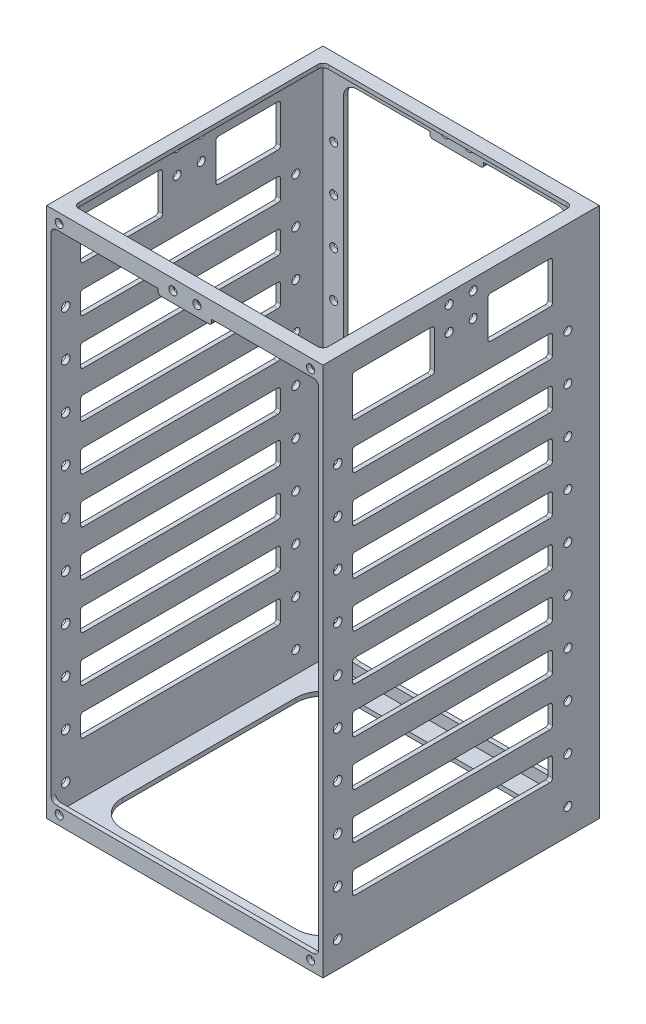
from build123d import *

# Parameters (mm, degrees)
SKETCH1_W           = 103.26
SKETCH1_H           = 103.26
BOSS_EXTRUDE2_DEPTH = 1.63
SKETCH3_W           = 103.26
SKETCH3_H           = 103.26
SKETCH3_W_2         = 100
SKETCH3_H_2         = 100
BOSS_EXTRUDE3_DEPTH = 196.74
CUT_EXTRUDE1_DEPTH  = 1.63
SKETCH6_R           = 1.6
SKETCH6_R_2         = 1.5
CUT_EXTRUDE2_DEPTH  = 230.518934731
CUT_EXTRUDE3_DEPTH  = 1.63
CUT_EXTRUDE4_DEPTH  = 230.518934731
CUT_EXTRUDE5_DEPTH  = 230.518934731
SKETCH15_W          = 20
SKETCH15_H          = 15.62
BOSS_EXTRUDE4_DEPTH = 1.63
SKETCH16_W          = 20
SKETCH16_H          = 15.62
BOSS_EXTRUDE5_DEPTH = 1.63
SKETCH9_R           = 1.5
CUT_EXTRUDE6_DEPTH  = 230.518934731
FILLET1_R           = 1
BOSS_EXTRUDE7_DEPTH = 1.63
BOSS_EXTRUDE6_START = -1.63
BOSS_EXTRUDE6_DEPTH = 1.63
SKETCH19_R          = 1.5
CUT_EXTRUDE7_DEPTH  = 230.518934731
SKETCH20_R          = 1.5
CUT_EXTRUDE8_DEPTH  = 1.63
SKETCH23_R          = 1.5
CUT_EXTRUDE10_DEPTH = 1.63
SKETCH25_W          = 100
SKETCH25_H          = 100
BOSS_EXTRUDE8_DEPTH = 1.5
CUT_EXTRUDE11_DEPTH = 1.5


with BuildPart() as part:
    # Sketch1 → Boss-Extrude2 (new body)
    with BuildSketch(Plane(origin=(0, 0, 0), x_dir=(1, 0, 0), z_dir=(0, 1, 0))):
        Rectangle(SKETCH1_W, SKETCH1_H)
        with BuildLine():
            Line((-32.5, -42.5), (32.5, -42.5))
            ThreePointArc((32.5, -42.5), (39.571067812, -39.571067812), (42.5, -32.5))
            Line((42.5, -32.5), (42.5, 32.5))
            ThreePointArc((42.5, 32.5), (39.571067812, 39.571067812), (32.5, 42.5))
            Line((32.5, 42.5), (-32.5, 42.5))
            ThreePointArc((-32.5, 42.5), (-39.571067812, 39.571067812), (-42.5, 32.5))
            Line((-42.5, 32.5), (-42.5, -32.5))
            ThreePointArc((-42.5, -32.5), (-39.571067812, -39.571067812), (-32.5, -42.5))
        make_face(mode=Mode.SUBTRACT)
    extrude(amount=BOSS_EXTRUDE2_DEPTH)

    # Sketch3 → Boss-Extrude3 (add)
    with BuildSketch(Plane(origin=(0, 1.63, 0), x_dir=(1, 0, 0), z_dir=(0, 1, 0))):
        Rectangle(SKETCH3_W, SKETCH3_H)
        Rectangle(SKETCH3_W_2, SKETCH3_H_2, mode=Mode.SUBTRACT)
    extrude(amount=BOSS_EXTRUDE3_DEPTH)

    # Sketch4 → Cut-Extrude1 (cut)
    with BuildSketch(Plane.XY.offset(-51.63)):
        with BuildLine():
            Line((-37.38, 6), (37.38, 6))
            ThreePointArc((37.38, 6), (40.915533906, 7.464466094), (42.38, 11))
            Line((42.38, 11), (42.38, 187.37))
            ThreePointArc((42.38, 187.37), (40.915533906, 190.905533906), (37.38, 192.37))
            Line((37.38, 192.37), (-37.38, 192.37))
            ThreePointArc((-37.38, 192.37), (-40.915533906, 190.905533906), (-42.38, 187.37))
            Line((-42.38, 187.37), (-42.38, 11))
            ThreePointArc((-42.38, 11), (-40.915533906, 7.464466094), (-37.38, 6))
        make_face()
    extrude(amount=CUT_EXTRUDE1_DEPTH, mode=Mode.SUBTRACT)

    # Sketch6 → Cut-Extrude2 (cut, through all)
    with BuildSketch(Plane(origin=(51.63, 0, 0), x_dir=(0, 0, -1), z_dir=(1, 0, 0))):
        with Locations((-46.13, 9.75)):
            Circle(SKETCH6_R)
        with Locations((39.87, 9.75)):
            Circle(SKETCH6_R_2)
        with Locations((-46.13, 26.85)):
            Circle(SKETCH6_R)
        with Locations((39.87, 26.85)):
            Circle(SKETCH6_R_2)
        with Locations((-46.13, 43.95)):
            Circle(SKETCH6_R)
        with Locations((39.87, 43.95)):
            Circle(SKETCH6_R_2)
        with Locations((-46.13, 61.05)):
            Circle(SKETCH6_R)
        with Locations((39.87, 61.05)):
            Circle(SKETCH6_R_2)
        with Locations((-46.13, 78.15)):
            Circle(SKETCH6_R)
        with Locations((39.87, 78.15)):
            Circle(SKETCH6_R_2)
        with Locations((-46.13, 95.25)):
            Circle(SKETCH6_R)
        with Locations((39.87, 95.25)):
            Circle(SKETCH6_R_2)
        with Locations((-46.13, 112.35)):
            Circle(SKETCH6_R)
        with Locations((39.87, 112.35)):
            Circle(SKETCH6_R_2)
        with Locations((-46.13, 129.45)):
            Circle(SKETCH6_R)
        with Locations((39.87, 129.45)):
            Circle(SKETCH6_R_2)
        with Locations((-46.13, 146.55)):
            Circle(SKETCH6_R)
        with Locations((39.87, 146.55)):
            Circle(SKETCH6_R_2)
        with Locations((-46.13, 163.65)):
            Circle(SKETCH6_R)
        with Locations((39.87, 163.65)):
            Circle(SKETCH6_R_2)
    extrude(amount=-CUT_EXTRUDE2_DEPTH, mode=Mode.SUBTRACT)

    # Sketch5 → Cut-Extrude3 (cut)
    with BuildSketch(Plane.XY.offset(51.63)):
        with BuildLine():
            Line((-48, 6.13), (48, 6.13))
            ThreePointArc((48, 6.13), (49.414213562, 6.715786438), (50, 8.13))
            Line((50, 8.13), (50, 190.37))
            ThreePointArc((50, 190.37), (49.414213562, 191.784213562), (48, 192.37))
            Line((48, 192.37), (-48, 192.37))
            ThreePointArc((-48, 192.37), (-49.414213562, 191.784213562), (-50, 190.37))
            Line((-50, 190.37), (-50, 8.13))
            ThreePointArc((-50, 8.13), (-49.414213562, 6.715786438), (-48, 6.13))
        make_face()
    extrude(amount=-CUT_EXTRUDE3_DEPTH, mode=Mode.SUBTRACT)

    # Sketch7 → Cut-Extrude4 (cut, through all)
    with BuildSketch(Plane(origin=(51.63, 0, 0), x_dir=(0, 0, -1), z_dir=(1, 0, 0))):
        with BuildLine():
            Line((-40.63, 38.95), (-40.63, 45.45))
            ThreePointArc((-40.63, 45.45), (-40.337106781, 46.157106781), (-39.63, 46.45))
            Line((-39.63, 46.45), (33.12, 46.45))
            ThreePointArc((33.12, 46.45), (33.827106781, 46.157106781), (34.12, 45.45))
            Line((34.12, 45.45), (34.12, 38.95))
            ThreePointArc((34.12, 38.95), (33.827106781, 38.242893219), (33.12, 37.95))
            Line((33.12, 37.95), (-39.63, 37.95))
            ThreePointArc((-39.63, 37.95), (-40.337106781, 38.242893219), (-40.63, 38.95))
        make_face()
        with BuildLine():
            Line((-39.63, 20.85), (33.12, 20.85))
            ThreePointArc((33.12, 20.85), (33.827106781, 21.142893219), (34.12, 21.85))
            Line((34.12, 21.85), (34.12, 28.35))
            ThreePointArc((34.12, 28.35), (33.827106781, 29.057106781), (33.12, 29.35))
            Line((33.12, 29.35), (-39.63, 29.35))
            ThreePointArc((-39.63, 29.35), (-40.337106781, 29.057106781), (-40.63, 28.35))
            Line((-40.63, 28.35), (-40.63, 21.85))
            ThreePointArc((-40.63, 21.85), (-40.337106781, 21.142893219), (-39.63, 20.85))
        make_face()
        with BuildLine():
            Line((-40.63, 158.65), (-40.63, 165.15))
            ThreePointArc((-40.63, 165.15), (-40.337106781, 165.857106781), (-39.63, 166.15))
            Line((-39.63, 166.15), (33.12, 166.15))
            ThreePointArc((33.12, 166.15), (33.827106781, 165.857106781), (34.12, 165.15))
            Line((34.12, 165.15), (34.12, 158.65))
            ThreePointArc((34.12, 158.65), (33.827106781, 157.942893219), (33.12, 157.65))
            Line((33.12, 157.65), (-39.63, 157.65))
            ThreePointArc((-39.63, 157.65), (-40.337106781, 157.942893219), (-40.63, 158.65))
        make_face()
        with BuildLine():
            Line((-40.63, 56.05), (-40.63, 62.55))
            ThreePointArc((-40.63, 62.55), (-40.337106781, 63.257106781), (-39.63, 63.55))
            Line((-39.63, 63.55), (33.12, 63.55))
            ThreePointArc((33.12, 63.55), (33.827106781, 63.257106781), (34.12, 62.55))
            Line((34.12, 62.55), (34.12, 56.05))
            ThreePointArc((34.12, 56.05), (33.827106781, 55.342893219), (33.12, 55.05))
            Line((33.12, 55.05), (-39.63, 55.05))
            ThreePointArc((-39.63, 55.05), (-40.337106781, 55.342893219), (-40.63, 56.05))
        make_face()
        with BuildLine():
            Line((-40.63, 73.15), (-40.63, 79.65))
            ThreePointArc((-40.63, 79.65), (-40.337106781, 80.357106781), (-39.63, 80.65))
            Line((-39.63, 80.65), (33.12, 80.65))
            ThreePointArc((33.12, 80.65), (33.827106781, 80.357106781), (34.12, 79.65))
            Line((34.12, 79.65), (34.12, 73.15))
            ThreePointArc((34.12, 73.15), (33.827106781, 72.442893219), (33.12, 72.15))
            Line((33.12, 72.15), (-39.63, 72.15))
            ThreePointArc((-39.63, 72.15), (-40.337106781, 72.442893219), (-40.63, 73.15))
        make_face()
        with BuildLine():
            Line((-40.63, 90.25), (-40.63, 96.75))
            ThreePointArc((-40.63, 96.75), (-40.337106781, 97.457106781), (-39.63, 97.75))
            Line((-39.63, 97.75), (33.12, 97.75))
            ThreePointArc((33.12, 97.75), (33.827106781, 97.457106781), (34.12, 96.75))
            Line((34.12, 96.75), (34.12, 90.25))
            ThreePointArc((34.12, 90.25), (33.827106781, 89.542893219), (33.12, 89.25))
            Line((33.12, 89.25), (-39.63, 89.25))
            ThreePointArc((-39.63, 89.25), (-40.337106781, 89.542893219), (-40.63, 90.25))
        make_face()
        with BuildLine():
            Line((-40.63, 107.35), (-40.63, 113.85))
            ThreePointArc((-40.63, 113.85), (-40.337106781, 114.557106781), (-39.63, 114.85))
            Line((-39.63, 114.85), (33.12, 114.85))
            ThreePointArc((33.12, 114.85), (33.827106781, 114.557106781), (34.12, 113.85))
            Line((34.12, 113.85), (34.12, 107.35))
            ThreePointArc((34.12, 107.35), (33.827106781, 106.642893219), (33.12, 106.35))
            Line((33.12, 106.35), (-39.63, 106.35))
            ThreePointArc((-39.63, 106.35), (-40.337106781, 106.642893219), (-40.63, 107.35))
        make_face()
        with BuildLine():
            Line((-40.63, 124.45), (-40.63, 130.95))
            ThreePointArc((-40.63, 130.95), (-40.337106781, 131.657106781), (-39.63, 131.95))
            Line((-39.63, 131.95), (33.12, 131.95))
            ThreePointArc((33.12, 131.95), (33.827106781, 131.657106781), (34.12, 130.95))
            Line((34.12, 130.95), (34.12, 124.45))
            ThreePointArc((34.12, 124.45), (33.827106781, 123.742893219), (33.12, 123.45))
            Line((33.12, 123.45), (-39.63, 123.45))
            ThreePointArc((-39.63, 123.45), (-40.337106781, 123.742893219), (-40.63, 124.45))
        make_face()
        with BuildLine():
            Line((-40.63, 141.55), (-40.63, 148.05))
            ThreePointArc((-40.63, 148.05), (-40.337106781, 148.757106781), (-39.63, 149.05))
            Line((-39.63, 149.05), (33.12, 149.05))
            ThreePointArc((33.12, 149.05), (33.827106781, 148.757106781), (34.12, 148.05))
            Line((34.12, 148.05), (34.12, 141.55))
            ThreePointArc((34.12, 141.55), (33.827106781, 140.842893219), (33.12, 140.55))
            Line((33.12, 140.55), (-39.63, 140.55))
            ThreePointArc((-39.63, 140.55), (-40.337106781, 140.842893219), (-40.63, 141.55))
        make_face()
    extrude(amount=-CUT_EXTRUDE4_DEPTH, mode=Mode.SUBTRACT)

    # Sketch8 → Cut-Extrude5 (cut, through all)
    with BuildSketch(Plane(origin=(51.63, 0, 0), x_dir=(0, 0, -1), z_dir=(1, 0, 0))):
        with BuildLine():
            Line((-39.63, 190.37), (33.12, 190.37))
            ThreePointArc((33.12, 190.37), (33.827106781, 190.077106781), (34.12, 189.37))
            Line((34.12, 189.37), (34.12, 175.75))
            ThreePointArc((34.12, 175.75), (33.827106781, 175.042893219), (33.12, 174.75))
            Line((33.12, 174.75), (-39.63, 174.75))
            ThreePointArc((-39.63, 174.75), (-40.337106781, 175.042893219), (-40.63, 175.75))
            Line((-40.63, 175.75), (-40.63, 189.37))
            ThreePointArc((-40.63, 189.37), (-40.337106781, 190.077106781), (-39.63, 190.37))
        make_face()
    extrude(amount=-CUT_EXTRUDE5_DEPTH, mode=Mode.SUBTRACT)

    # Sketch15 → Boss-Extrude4 (add)
    with BuildSketch(Plane(origin=(51.63, 0, 0), x_dir=(0, 0, -1), z_dir=(1, 0, 0))):
        with Locations((0, 182.56)):
            Rectangle(SKETCH15_W, SKETCH15_H)
    extrude(amount=-BOSS_EXTRUDE4_DEPTH)

    # Sketch16 → Boss-Extrude5 (add)
    with BuildSketch(Plane.ZY.offset(51.63)):
        with Locations((0, 182.56)):
            Rectangle(SKETCH16_W, SKETCH16_H)
    extrude(amount=-BOSS_EXTRUDE5_DEPTH)

    # Sketch9 → Cut-Extrude6 (cut, through all)
    with BuildSketch(Plane(origin=(51.63, 0, 0), x_dir=(0, 0, -1), z_dir=(1, 0, 0))):
        with Locations((-4.5, 194.37)):
            Circle(SKETCH9_R)
        with Locations((4.5, 194.37)):
            Circle(SKETCH9_R)
        with Locations(Location((4.5, 185.37, 0), (0, 0, 180))):
            Circle(SKETCH9_R)
        with Locations(Location((-4.5, 185.37, 0), (0, 0, 180))):
            Circle(SKETCH9_R)
    extrude(amount=-CUT_EXTRUDE6_DEPTH, mode=Mode.SUBTRACT)

    # Fillet1
    fillet1_edges = [part.edges().sort_by_distance(p)[0] for p in [
        (50.815, 174.75, -10),
        (50.815, 190.37, -10),
        (50.815, 190.37, 10),
        (50.815, 174.75, 10),
        (-50.815, 174.75, -10),
        (-50.815, 190.37, -10),
        (-50.815, 190.37, 10),
        (-50.815, 174.75, 10),
    ]]
    fillet(fillet1_edges, radius=FILLET1_R)

    # Sketch18 → Boss-Extrude7 (add)
    with BuildSketch(Plane(origin=(0, 0, -51.63), x_dir=(-1, 0, 0), z_dir=(0, 0, -1))):
        with BuildLine():
            Line((-10, 192.37), (10, 192.37))
            Line((10, 192.37), (10, 191.37))
            ThreePointArc((10, 191.37), (9.707106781, 190.662893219), (9, 190.37))
            Line((9, 190.37), (-9, 190.37))
            ThreePointArc((-9, 190.37), (-9.707106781, 190.662893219), (-10, 191.37))
            Line((-10, 191.37), (-10, 192.37))
        make_face()
    extrude(amount=-BOSS_EXTRUDE7_DEPTH)

    # Sketch17 → Boss-Extrude6 (add)
    with BuildSketch(Plane.XY.offset(51.63).offset(BOSS_EXTRUDE6_START)):
        with BuildLine():
            Line((-10, 192.37), (10, 192.37))
            Line((10, 192.37), (10, 191.37))
            ThreePointArc((10, 191.37), (9.707106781, 190.662893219), (9, 190.37))
            Line((9, 190.37), (-9, 190.37))
            ThreePointArc((-9, 190.37), (-9.707106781, 190.662893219), (-10, 191.37))
            Line((-10, 191.37), (-10, 192.37))
        make_face()
    extrude(amount=BOSS_EXTRUDE6_DEPTH)

    # Sketch19 → Cut-Extrude7 (cut, through all)
    with BuildSketch(Plane.XY.offset(51.63)):
        with Locations((-4.5, 194.37)):
            Circle(SKETCH19_R)
        with Locations(Location((4.5, 194.37, 0), (0, 0, 180))):
            Circle(SKETCH19_R)
    extrude(amount=-CUT_EXTRUDE7_DEPTH, mode=Mode.SUBTRACT)

    # Sketch20 → Cut-Extrude8 (cut)
    with BuildSketch(Plane.XY.offset(51.63)):
        with Locations((-46.98, 3.5)):
            Circle(SKETCH20_R)
        with Locations((-46.98, 194.87)):
            Circle(SKETCH20_R)
        with Locations(Location((46.98, 3.5, 0), (0, 0, 180))):
            Circle(SKETCH20_R)
        with Locations(Location((46.98, 194.87, 0), (0, 0, 180))):
            Circle(SKETCH20_R)
    extrude(amount=-CUT_EXTRUDE8_DEPTH, mode=Mode.SUBTRACT)

    # Sketch23 → Cut-Extrude10 (cut)
    with BuildSketch(Plane(origin=(0, 0, -51.63), x_dir=(-1, 0, 0), z_dir=(0, 0, -1))):
        with Locations((-46, 17.05)):
            Circle(SKETCH23_R)
        with Locations((-46, 34.15)):
            Circle(SKETCH23_R)
        with Locations((-46, 51.25)):
            Circle(SKETCH23_R)
        with Locations((-46, 68.35)):
            Circle(SKETCH23_R)
        with Locations((-46, 85.45)):
            Circle(SKETCH23_R)
        with Locations((-46, 102.55)):
            Circle(SKETCH23_R)
        with Locations((-46, 119.65)):
            Circle(SKETCH23_R)
        with Locations((-46, 136.75)):
            Circle(SKETCH23_R)
        with Locations((-46, 153.85)):
            Circle(SKETCH23_R)
        with Locations((-46, 170.95)):
            Circle(SKETCH23_R)
        with Locations((46, 170.95)):
            Circle(SKETCH23_R)
        with Locations((46, 153.85)):
            Circle(SKETCH23_R)
        with Locations((46, 136.75)):
            Circle(SKETCH23_R)
        with Locations((46, 119.65)):
            Circle(SKETCH23_R)
        with Locations((46, 102.55)):
            Circle(SKETCH23_R)
        with Locations((46, 85.45)):
            Circle(SKETCH23_R)
        with Locations((46, 68.35)):
            Circle(SKETCH23_R)
        with Locations((46, 51.25)):
            Circle(SKETCH23_R)
        with Locations((46, 34.15)):
            Circle(SKETCH23_R)
        with Locations((46, 17.05)):
            Circle(SKETCH23_R)
    extrude(amount=-CUT_EXTRUDE10_DEPTH, mode=Mode.SUBTRACT)

    # Sketch25 → Boss-Extrude8 (add)
    with BuildSketch(Plane(origin=(0, 198.37, 0), x_dir=(1, 0, 0), z_dir=(0, 1, 0))):
        Rectangle(SKETCH25_W, SKETCH25_H)
    extrude(amount=-BOSS_EXTRUDE8_DEPTH)

    # Sketch26 → Cut-Extrude11 (cut)
    with BuildSketch(Plane(origin=(0, 198.37, 0), x_dir=(1, 0, 0), z_dir=(0, 1, 0))):
        with BuildLine():
            Line((-44.63, -46.63), (44.63, -46.63))
            ThreePointArc((44.63, -46.63), (46.044213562, -46.044213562), (46.63, -44.63))
            Line((46.63, -44.63), (46.63, 44.63))
            ThreePointArc((46.63, 44.63), (46.044213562, 46.044213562), (44.63, 46.63))
            Line((44.63, 46.63), (-44.63, 46.63))
            ThreePointArc((-44.63, 46.63), (-46.044213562, 46.044213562), (-46.63, 44.63))
            Line((-46.63, 44.63), (-46.63, -44.63))
            ThreePointArc((-46.63, -44.63), (-46.044213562, -46.044213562), (-44.63, -46.63))
        make_face()
    extrude(amount=-CUT_EXTRUDE11_DEPTH, mode=Mode.SUBTRACT)


solid = part.part
